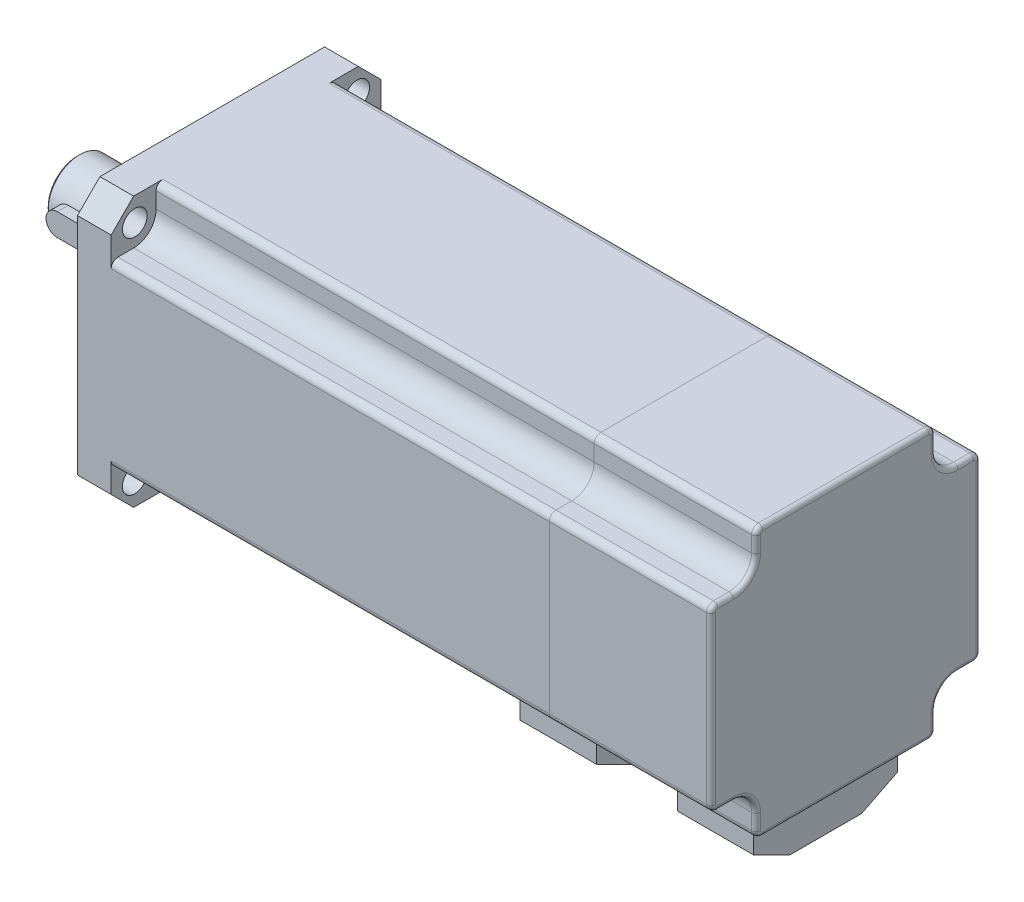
from build123d import *

# Parameters (mm, degrees)
EXTRUDE_1_DEPTH     = 105
EXTRUDE_2_DEPTH     = 36
CUT_EXTRUDE_1_DEPTH = 133.5
FILLET_1_R          = 1
SKETCH_4_R          = 2.75
CUT_EXTRUDE_2_DEPTH = 7.5
SKETCH_5_R          = 25
SKETCH_5_R_2        = 22.5
EXTRUDE_3_DEPTH     = 3
SKETCH_6_R          = 7.5
EXTRUDE_4_DEPTH     = 5
FILLET_2_R          = 0.5
SKETCH_7_R          = 7
EXTRUDE_5_DEPTH     = 25
CHAMFER_1_SIZE      = 0.5
CUT_EXTRUDE_3_DEPTH = 3
EXTRUDE_6_DEPTH     = 5
SKETCH_10_W         = 17
SKETCH_10_H         = 32
EXTRUDE_7_DEPTH     = 11
EXTRUDE_7_2_DEPTH   = 11
CUT_EXTRUDE_5_DEPTH = 52


with BuildPart() as part:
    # Sketch 1 → Extrude 1 (new body)
    with BuildSketch(Plane(origin=(0, 0, 0), x_dir=(0, 0, -1), z_dir=(1, 0, 0))):
        Polygon((-30, 25), (-25, 30), (25, 30), (30, 25), (30, -25), (25, -30), (-25, -30), (-30, -25), align=None)
    extrude(amount=EXTRUDE_1_DEPTH)


with BuildPart() as body_2:
    # Sketch 2 → Extrude 2 (new body)
    with BuildSketch(Plane(origin=(105, 0, 0), x_dir=(0, 0, -1), z_dir=(1, 0, 0))):
        Polygon((-25, -30), (25, -30), (30, -25), (30, 25), (25, 30), (-25, 30), (-30, 25), (-30, -25), align=None)
    extrude(amount=EXTRUDE_2_DEPTH)


with BuildPart() as cut_extrude_1_tool:
    # Sketch 3 → Cut-Extrude 1 (new body)
    with BuildSketch(Plane(origin=(141, 0, 0), x_dir=(0, 0, -1), z_dir=(1, 0, 0))):
        with BuildLine():
            Line((-25, 20), (-28.5, 20))
            ThreePointArc((-28.5, 20), (-29.560660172, 19.560660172), (-30, 18.5))
            Line((-30, 18.5), (-30, 25))
            Line((-30, 25), (-25, 30))
            Line((-25, 30), (-18.5, 30))
            ThreePointArc((-18.5, 30), (-19.560660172, 29.560660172), (-20, 28.5))
            Line((-20, 28.5), (-20, 25))
            ThreePointArc((-20, 25), (-21.464466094, 21.464466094), (-25, 20))
        make_face()
        with BuildLine():
            Line((18.5, 30), (25, 30))
            Line((25, 30), (30, 25))
            Line((30, 25), (30, 18.5))
            ThreePointArc((30, 18.5), (29.560660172, 19.560660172), (28.5, 20))
            Line((28.5, 20), (25, 20))
            ThreePointArc((25, 20), (21.464466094, 21.464466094), (20, 25))
            Line((20, 25), (20, 28.5))
            ThreePointArc((20, 28.5), (19.560660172, 29.560660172), (18.5, 30))
        make_face()
        with BuildLine():
            Line((-28.5, -20), (-25, -20))
            ThreePointArc((-25, -20), (-21.464466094, -21.464466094), (-20, -25))
            Line((-20, -25), (-20, -28.5))
            ThreePointArc((-20, -28.5), (-19.560660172, -29.560660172), (-18.5, -30))
            Line((-18.5, -30), (-25, -30))
            Line((-25, -30), (-30, -25))
            Line((-30, -25), (-30, -18.5))
            ThreePointArc((-30, -18.5), (-29.560660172, -19.560660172), (-28.5, -20))
        make_face()
        with BuildLine():
            Line((30, -18.5), (30, -25))
            Line((30, -25), (25, -30))
            Line((25, -30), (18.5, -30))
            ThreePointArc((18.5, -30), (19.560660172, -29.560660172), (20, -28.5))
            Line((20, -28.5), (20, -25))
            ThreePointArc((20, -25), (21.464466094, -21.464466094), (25, -20))
            Line((25, -20), (28.5, -20))
            ThreePointArc((28.5, -20), (29.560660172, -19.560660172), (30, -18.5))
        make_face()
    extrude(amount=-CUT_EXTRUDE_1_DEPTH)


with BuildPart() as part_1:
    add(part.part)

    # Cut-Extrude 1: cut by cut_extrude_1_tool
    add(cut_extrude_1_tool.part, mode=Mode.SUBTRACT)

    # Sketch 4 → Cut-Extrude 2 (cut)
    with BuildSketch(Plane.ZY):
        with Locations((-24.748737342, 24.748737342)):
            Circle(SKETCH_4_R)
        with Locations((24.748737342, 24.748737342)):
            Circle(SKETCH_4_R)
        with Locations((-24.748737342, -24.748737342)):
            Circle(SKETCH_4_R)
        with Locations((24.748737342, -24.748737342)):
            Circle(SKETCH_4_R)
    extrude(amount=-CUT_EXTRUDE_2_DEPTH, mode=Mode.SUBTRACT)



with BuildPart() as body_2_1:
    add(body_2.part)

    # Cut-Extrude 1: cut by cut_extrude_1_tool
    add(cut_extrude_1_tool.part, mode=Mode.SUBTRACT)

    # Fillet 1
    fillet_1_edges = [body_2_1.edges().sort_by_distance(p)[0] for p in [
        (141, 21.464466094, -21.464466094),
        (141, 20, -26.75),
        (141, 19.560660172, -29.560660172),
        (141, 29.560660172, -19.560660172),
        (141, 26.75, -20),
        (141, 0, 30),
        (141, -30, 0),
        (141, 0, -30),
        (141, 30, 0),
        (141, -19.560660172, 29.560660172),
        (141, -29.560660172, 19.560660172),
        (141, -26.75, 20),
        (141, -21.464466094, 21.464466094),
        (141, -20, 26.75),
        (141, 21.464466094, 21.464466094),
        (141, 26.75, 20),
        (141, 29.560660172, 19.560660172),
        (141, 19.560660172, 29.560660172),
        (141, 20, 26.75),
        (141, -21.464466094, -21.464466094),
        (141, -26.75, -20),
        (141, -29.560660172, -19.560660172),
        (141, -19.560660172, -29.560660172),
        (141, -20, -26.75),
    ]]
    fillet(fillet_1_edges, radius=FILLET_1_R)


with BuildPart() as body_3:
    # Sketch 5 → Extrude 3 (new body)
    with BuildSketch(Plane.ZY):
        Circle(SKETCH_5_R)
        Circle(SKETCH_5_R_2, mode=Mode.SUBTRACT)
    extrude(amount=EXTRUDE_3_DEPTH)


with BuildPart() as part_2:
    add(part_1.part)

    add(body_3.part)  # Extrude 4 merges body 3
    # Sketch 6 → Extrude 4 (add)
    with BuildSketch(Plane.ZY):
        Circle(SKETCH_6_R)
    extrude(amount=EXTRUDE_4_DEPTH)

    # Fillet 2
    fillet_2_edges = [part_2.edges().sort_by_distance(p)[0] for p in [
        (-5, 0, -7.5),
    ]]
    fillet(fillet_2_edges, radius=FILLET_2_R)

    # Sketch 7 → Extrude 5 (add)
    with BuildSketch(Plane.ZY.offset(5)):
        Circle(SKETCH_7_R)
    extrude(amount=EXTRUDE_5_DEPTH)

    # Chamfer 1
    chamfer_1_edges = [part_2.edges().sort_by_distance(p)[0] for p in [
        (-30, 0, -7),
    ]]
    chamfer(chamfer_1_edges, length=CHAMFER_1_SIZE)

    # Sketch 8 → Cut-Extrude 3 (cut)
    with BuildSketch(Plane.XY.offset(7)):
        with BuildLine():
            Line((-25.5, 2.5), (-10, 2.5))
            ThreePointArc((-10, 2.5), (-7.5, 0), (-10, -2.5))
            Line((-10, -2.5), (-25.5, -2.5))
            ThreePointArc((-25.5, -2.5), (-28, 0), (-25.5, 2.5))
        make_face()
    extrude(amount=-CUT_EXTRUDE_3_DEPTH, mode=Mode.SUBTRACT)


with BuildPart() as body_3_2:
    # Sketch 9 → Extrude 6 (new body)
    with BuildSketch(Plane.XY.offset(4)):
        with BuildLine():
            Line((-25.5, 2.5), (-10, 2.5))
            ThreePointArc((-10, 2.5), (-7.5, 0), (-10, -2.5))
            Line((-10, -2.5), (-25.5, -2.5))
            ThreePointArc((-25.5, -2.5), (-28, 0), (-25.5, 2.5))
        make_face()
    extrude(amount=EXTRUDE_6_DEPTH)


with BuildPart() as body_4:
    # Sketch 10 → Extrude 7 (new body)
    with BuildSketch(Plane(origin=(0, -30, 0), x_dir=(-1, 0, 0), z_dir=(0, -1, 0))):
        with Locations((-93, 0)):
            Rectangle(SKETCH_10_W, SKETCH_10_H)
    extrude(amount=EXTRUDE_7_DEPTH)


with BuildPart() as body_5:
    # Sketch 10 → Extrude 7 2 (new body)
    with BuildSketch(Plane(origin=(0, -30, 0), x_dir=(-1, 0, 0), z_dir=(0, -1, 0))):
        with Locations((-128, 0)):
            Rectangle(SKETCH_10_W, SKETCH_10_H)
    extrude(amount=EXTRUDE_7_2_DEPTH)


with BuildPart() as cut_extrude_5_tool:
    # Sketch 13 → Cut-Extrude 5 (new body)
    with BuildSketch(Plane.ZY.offset(-84.5)):
        Polygon((-16, -41), (-16, -37), (-8, -41), align=None)
        Polygon((16, -41), (16, -37), (8, -41), align=None)
    extrude(amount=-CUT_EXTRUDE_5_DEPTH)


with BuildPart() as body_4_1:
    add(body_4.part)

    # Cut-Extrude 5: cut by cut_extrude_5_tool
    add(cut_extrude_5_tool.part, mode=Mode.SUBTRACT)


with BuildPart() as body_5_1:
    add(body_5.part)

    # Cut-Extrude 5: cut by cut_extrude_5_tool
    add(cut_extrude_5_tool.part, mode=Mode.SUBTRACT)


solid = Compound([body_2_1.part, part_2.part, body_3_2.part, body_4_1.part, body_5_1.part])
